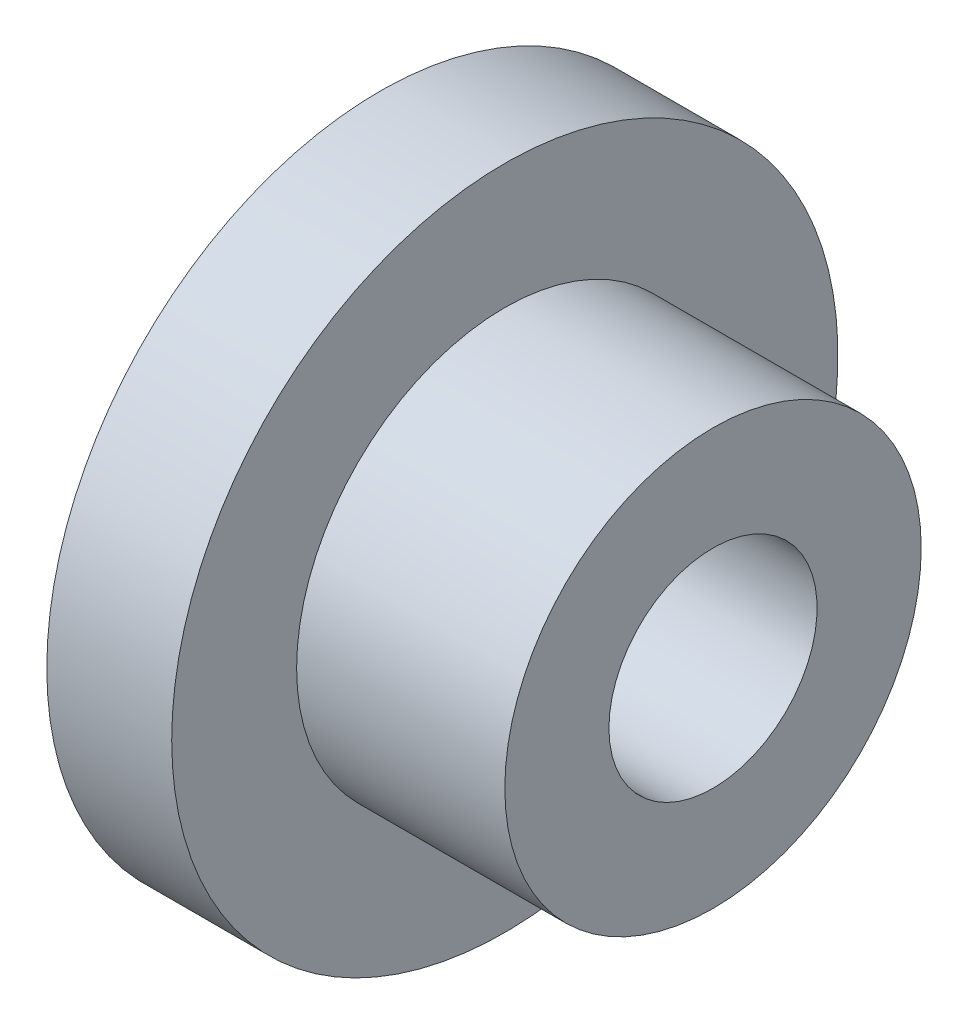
ISO-10303-21;
HEADER;
FILE_DESCRIPTION(('STEP AP214'),'2;1');
FILE_NAME('part.step','',(''),(''),'','','');
FILE_SCHEMA(('AUTOMOTIVE_DESIGN { 1 0 10303 214 1 1 1 1 }'));
ENDSEC;
DATA;
#1=APPLICATION_CONTEXT('core data for automotive mechanical design processes');
#2=APPLICATION_PROTOCOL_DEFINITION('international standard','automotive_design',2000,#1);
#3=PRODUCT_CONTEXT('',#1,'mechanical');
#4=PRODUCT('Part','Part','',(#3));
#5=PRODUCT_RELATED_PRODUCT_CATEGORY('part','',(#4));
#6=PRODUCT_DEFINITION_FORMATION('','',#4);
#7=PRODUCT_DEFINITION_CONTEXT('part definition',#1,'design');
#8=PRODUCT_DEFINITION('design','',#6,#7);
#9=PRODUCT_DEFINITION_SHAPE('','',#8);
#10=(LENGTH_UNIT() NAMED_UNIT(*) SI_UNIT(.MILLI.,.METRE.));
#11=(NAMED_UNIT(*) PLANE_ANGLE_UNIT() SI_UNIT($,.RADIAN.));
#12=(NAMED_UNIT(*) SI_UNIT($,.STERADIAN.) SOLID_ANGLE_UNIT());
#13=UNCERTAINTY_MEASURE_WITH_UNIT(LENGTH_MEASURE(1.E-05),#10,'distance_accuracy_value','');
#14=(GEOMETRIC_REPRESENTATION_CONTEXT(3) GLOBAL_UNCERTAINTY_ASSIGNED_CONTEXT((#13)) GLOBAL_UNIT_ASSIGNED_CONTEXT((#10,
#11,#12)) REPRESENTATION_CONTEXT('',''));
#15=CARTESIAN_POINT('',(0.,0.,0.));
#16=DIRECTION('',(0.,0.,1.));
#17=DIRECTION('',(1.,0.,0.));
#18=AXIS2_PLACEMENT_3D('',#15,#16,#17);
#19=CARTESIAN_POINT('',(0.,-4.94142135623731,0.));
#20=DIRECTION('',(1.,0.,0.));
#21=DIRECTION('',(0.,0.,-1.));
#22=AXIS2_PLACEMENT_3D('',#19,#20,#21);
#23=PLANE('',#22);
#24=CARTESIAN_POINT('',(0.,0.,0.));
#25=DIRECTION('',(-1.,0.,0.));
#26=DIRECTION('',(0.,0.,1.));
#27=AXIS2_PLACEMENT_3D('',#24,#25,#26);
#28=CIRCLE('',#27,2.5);
#29=CARTESIAN_POINT('',(0.,0.,2.5));
#30=VERTEX_POINT('',#29);
#31=EDGE_CURVE('E10',#30,#30,#28,.T.);
#32=ORIENTED_EDGE('',*,*,#31,.F.);
#33=EDGE_LOOP('',(#32));
#34=FACE_BOUND('',#33,.T.);
#35=CARTESIAN_POINT('',(0.,0.,0.));
#36=DIRECTION('',(-1.,0.,0.));
#37=DIRECTION('',(0.,0.,1.));
#38=AXIS2_PLACEMENT_3D('',#35,#36,#37);
#39=CIRCLE('',#38,8.);
#40=CARTESIAN_POINT('',(0.,0.,8.));
#41=VERTEX_POINT('',#40);
#42=EDGE_CURVE('E50',#41,#41,#39,.T.);
#43=ORIENTED_EDGE('',*,*,#42,.T.);
#44=EDGE_LOOP('',(#43));
#45=FACE_BOUND('',#44,.T.);
#46=ADVANCED_FACE('F28',(#34,#45),#23,.F.);
#47=CARTESIAN_POINT('',(0.,0.,0.));
#48=DIRECTION('',(-1.,0.,0.));
#49=DIRECTION('',(0.,0.,1.));
#50=AXIS2_PLACEMENT_3D('',#47,#48,#49);
#51=CYLINDRICAL_SURFACE('',#50,2.5);
#52=CARTESIAN_POINT('',(8.,0.,0.));
#53=DIRECTION('',(-1.,0.,0.));
#54=DIRECTION('',(0.,0.,1.));
#55=AXIS2_PLACEMENT_3D('',#52,#53,#54);
#56=CIRCLE('',#55,2.5);
#57=CARTESIAN_POINT('',(8.,0.,2.5));
#58=VERTEX_POINT('',#57);
#59=EDGE_CURVE('E34',#58,#58,#56,.T.);
#60=ORIENTED_EDGE('',*,*,#59,.F.);
#61=EDGE_LOOP('',(#60));
#62=FACE_BOUND('',#61,.T.);
#63=ORIENTED_EDGE('',*,*,#31,.T.);
#64=EDGE_LOOP('',(#63));
#65=FACE_BOUND('',#64,.T.);
#66=ADVANCED_FACE('F75',(#62,#65),#51,.F.);
#67=CARTESIAN_POINT('',(8.,-4.94142135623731,0.));
#68=DIRECTION('',(-1.,0.,0.));
#69=DIRECTION('',(0.,0.,1.));
#70=AXIS2_PLACEMENT_3D('',#67,#68,#69);
#71=PLANE('',#70);
#72=CARTESIAN_POINT('',(8.,0.,0.));
#73=DIRECTION('',(-1.,0.,0.));
#74=DIRECTION('',(0.,0.,1.));
#75=AXIS2_PLACEMENT_3D('',#72,#73,#74);
#76=CIRCLE('',#75,5.);
#77=CARTESIAN_POINT('',(8.,0.,5.));
#78=VERTEX_POINT('',#77);
#79=EDGE_CURVE('E38',#78,#78,#76,.T.);
#80=ORIENTED_EDGE('',*,*,#79,.F.);
#81=EDGE_LOOP('',(#80));
#82=FACE_BOUND('',#81,.T.);
#83=ORIENTED_EDGE('',*,*,#59,.T.);
#84=EDGE_LOOP('',(#83));
#85=FACE_BOUND('',#84,.T.);
#86=ADVANCED_FACE('F70',(#82,#85),#71,.F.);
#87=CARTESIAN_POINT('',(0.,0.,0.));
#88=DIRECTION('',(-1.,0.,0.));
#89=DIRECTION('',(0.,0.,1.));
#90=AXIS2_PLACEMENT_3D('',#87,#88,#89);
#91=CYLINDRICAL_SURFACE('',#90,5.);
#92=CARTESIAN_POINT('',(3.,0.,0.));
#93=DIRECTION('',(-1.,0.,0.));
#94=DIRECTION('',(0.,0.,1.));
#95=AXIS2_PLACEMENT_3D('',#92,#93,#94);
#96=CIRCLE('',#95,5.);
#97=CARTESIAN_POINT('',(3.,0.,5.));
#98=VERTEX_POINT('',#97);
#99=EDGE_CURVE('E42',#98,#98,#96,.T.);
#100=ORIENTED_EDGE('',*,*,#99,.F.);
#101=EDGE_LOOP('',(#100));
#102=FACE_BOUND('',#101,.T.);
#103=ORIENTED_EDGE('',*,*,#79,.T.);
#104=EDGE_LOOP('',(#103));
#105=FACE_BOUND('',#104,.T.);
#106=ADVANCED_FACE('F64',(#102,#105),#91,.T.);
#107=CARTESIAN_POINT('',(3.,-4.94142135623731,0.));
#108=DIRECTION('',(-1.,0.,0.));
#109=DIRECTION('',(0.,0.,1.));
#110=AXIS2_PLACEMENT_3D('',#107,#108,#109);
#111=PLANE('',#110);
#112=CARTESIAN_POINT('',(3.,0.,0.));
#113=DIRECTION('',(-1.,0.,0.));
#114=DIRECTION('',(0.,0.,1.));
#115=AXIS2_PLACEMENT_3D('',#112,#113,#114);
#116=CIRCLE('',#115,8.);
#117=CARTESIAN_POINT('',(3.,0.,8.));
#118=VERTEX_POINT('',#117);
#119=EDGE_CURVE('E47',#118,#118,#116,.T.);
#120=ORIENTED_EDGE('',*,*,#119,.F.);
#121=EDGE_LOOP('',(#120));
#122=FACE_BOUND('',#121,.T.);
#123=ORIENTED_EDGE('',*,*,#99,.T.);
#124=EDGE_LOOP('',(#123));
#125=FACE_BOUND('',#124,.T.);
#126=ADVANCED_FACE('F58',(#122,#125),#111,.F.);
#127=CARTESIAN_POINT('',(0.,0.,0.));
#128=DIRECTION('',(-1.,0.,0.));
#129=DIRECTION('',(0.,0.,1.));
#130=AXIS2_PLACEMENT_3D('',#127,#128,#129);
#131=CYLINDRICAL_SURFACE('',#130,8.);
#132=ORIENTED_EDGE('',*,*,#42,.F.);
#133=EDGE_LOOP('',(#132));
#134=FACE_BOUND('',#133,.T.);
#135=ORIENTED_EDGE('',*,*,#119,.T.);
#136=EDGE_LOOP('',(#135));
#137=FACE_BOUND('',#136,.T.);
#138=ADVANCED_FACE('F55',(#134,#137),#131,.T.);
#139=CLOSED_SHELL('',(#46,#66,#86,#106,#126,#138));
#140=MANIFOLD_SOLID_BREP('B2',#139);
#141=ADVANCED_BREP_SHAPE_REPRESENTATION('',(#18,#140),#14);
#142=SHAPE_DEFINITION_REPRESENTATION(#9,#141);
ENDSEC;
END-ISO-10303-21;
